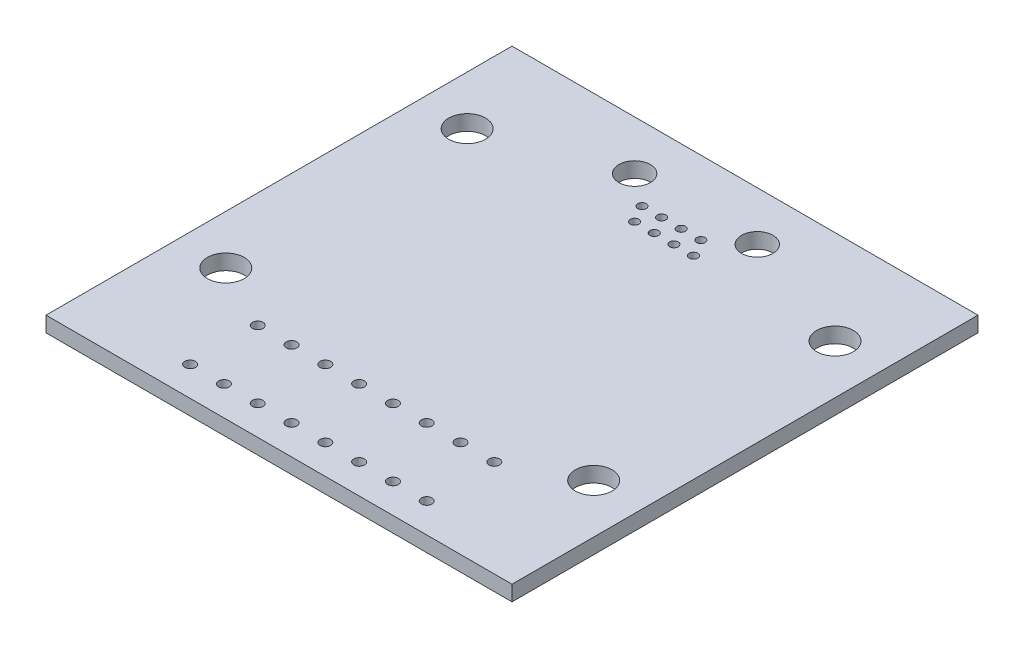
from build123d import *

# Parameters (mm, degrees)
SKETCH1_W           = 48.26
SKETCH1_H           = 48.26
SKETCH1_R           = 1.6256
SKETCH1_R_2         = 1.905
SKETCH1_R_3         = 0.55
SKETCH1_R_4         = 0.4445
BOSS_EXTRUDE1_DEPTH = 1.5875


with BuildPart() as part:
    # Sketch1 → Boss-Extrude1 (new body)
    with BuildSketch(Plane(origin=(0, 0, 0), x_dir=(1, 0, 0), z_dir=(0, 1, 0))):
        with Locations((0, 24.13)):
            Rectangle(SKETCH1_W, SKETCH1_H)
        with Locations(Location((-6.35, 43.18, 0), (0, 0, 270))):
            Circle(SKETCH1_R, mode=Mode.SUBTRACT)
        with Locations(Location((-19.05, 38.53434, 0), (0, 0, 270))):
            Circle(SKETCH1_R_2, mode=Mode.SUBTRACT)
        with Locations(Location((-19.05, 13.5382, 0), (0, 0, 270))):
            Circle(SKETCH1_R_2, mode=Mode.SUBTRACT)
        with Locations(Location((-12.25, 10.04824, 0), (0, 0, 270))):
            Circle(SKETCH1_R_3, mode=Mode.SUBTRACT)
        with Locations(Location((-12.25, 3.048, 0), (0, 0, 270))):
            Circle(SKETCH1_R_3, mode=Mode.SUBTRACT)
        with Locations(Location((-8.75, 3.048, 0), (0, 0, 270))):
            Circle(SKETCH1_R_3, mode=Mode.SUBTRACT)
        with Locations(Location((-8.75, 10.04824, 0), (0, 0, 270))):
            Circle(SKETCH1_R_3, mode=Mode.SUBTRACT)
        with Locations(Location((-5.25, 3.048, 0), (0, 0, 270))):
            Circle(SKETCH1_R_3, mode=Mode.SUBTRACT)
        with Locations(Location((-5.25, 10.04824, 0), (0, 0, 270))):
            Circle(SKETCH1_R_3, mode=Mode.SUBTRACT)
        with Locations(Location((-1.75, 10.04824, 0), (0, 0, 270))):
            Circle(SKETCH1_R_3, mode=Mode.SUBTRACT)
        with Locations(Location((-1.75, 3.048, 0), (0, 0, 270))):
            Circle(SKETCH1_R_3, mode=Mode.SUBTRACT)
        with Locations(Location((-3.048, 40.64, 0), (0, 0, 270))):
            Circle(SKETCH1_R_4, mode=Mode.SUBTRACT)
        with Locations(Location((-1.016, 40.64, 0), (0, 0, 270))):
            Circle(SKETCH1_R_4, mode=Mode.SUBTRACT)
        with Locations(Location((1.016, 40.64, 0), (0, 0, 270))):
            Circle(SKETCH1_R_4, mode=Mode.SUBTRACT)
        with Locations(Location((3.048, 40.64, 0), (0, 0, 270))):
            Circle(SKETCH1_R_4, mode=Mode.SUBTRACT)
        with Locations(Location((-2.032, 38.862, 0), (0, 0, 270))):
            Circle(SKETCH1_R_4, mode=Mode.SUBTRACT)
        with Locations(Location((0, 38.862, 0), (0, 0, 270))):
            Circle(SKETCH1_R_4, mode=Mode.SUBTRACT)
        with Locations(Location((2.032, 38.862, 0), (0, 0, 270))):
            Circle(SKETCH1_R_4, mode=Mode.SUBTRACT)
        with Locations(Location((4.064, 38.862, 0), (0, 0, 270))):
            Circle(SKETCH1_R_4, mode=Mode.SUBTRACT)
        with Locations(Location((6.35, 43.18, 0), (0, 0, 90))):
            Circle(SKETCH1_R, mode=Mode.SUBTRACT)
        with Locations(Location((19.05, 38.53434, 0), (0, 0, 90))):
            Circle(SKETCH1_R_2, mode=Mode.SUBTRACT)
        with Locations(Location((19.05, 13.5382, 0), (0, 0, 90))):
            Circle(SKETCH1_R_2, mode=Mode.SUBTRACT)
        with Locations(Location((12.25, 10.04824, 0), (0, 0, 90))):
            Circle(SKETCH1_R_3, mode=Mode.SUBTRACT)
        with Locations(Location((8.75, 10.04824, 0), (0, 0, 90))):
            Circle(SKETCH1_R_3, mode=Mode.SUBTRACT)
        with Locations(Location((5.25, 10.04824, 0), (0, 0, 90))):
            Circle(SKETCH1_R_3, mode=Mode.SUBTRACT)
        with Locations(Location((1.75, 10.04824, 0), (0, 0, 90))):
            Circle(SKETCH1_R_3, mode=Mode.SUBTRACT)
        with Locations(Location((1.75, 3.048, 0), (0, 0, 90))):
            Circle(SKETCH1_R_3, mode=Mode.SUBTRACT)
        with Locations(Location((5.25, 3.048, 0), (0, 0, 90))):
            Circle(SKETCH1_R_3, mode=Mode.SUBTRACT)
        with Locations(Location((8.75, 3.048, 0), (0, 0, 90))):
            Circle(SKETCH1_R_3, mode=Mode.SUBTRACT)
        with Locations(Location((12.25, 3.048, 0), (0, 0, 90))):
            Circle(SKETCH1_R_3, mode=Mode.SUBTRACT)
    extrude(amount=BOSS_EXTRUDE1_DEPTH)


solid = part.part
